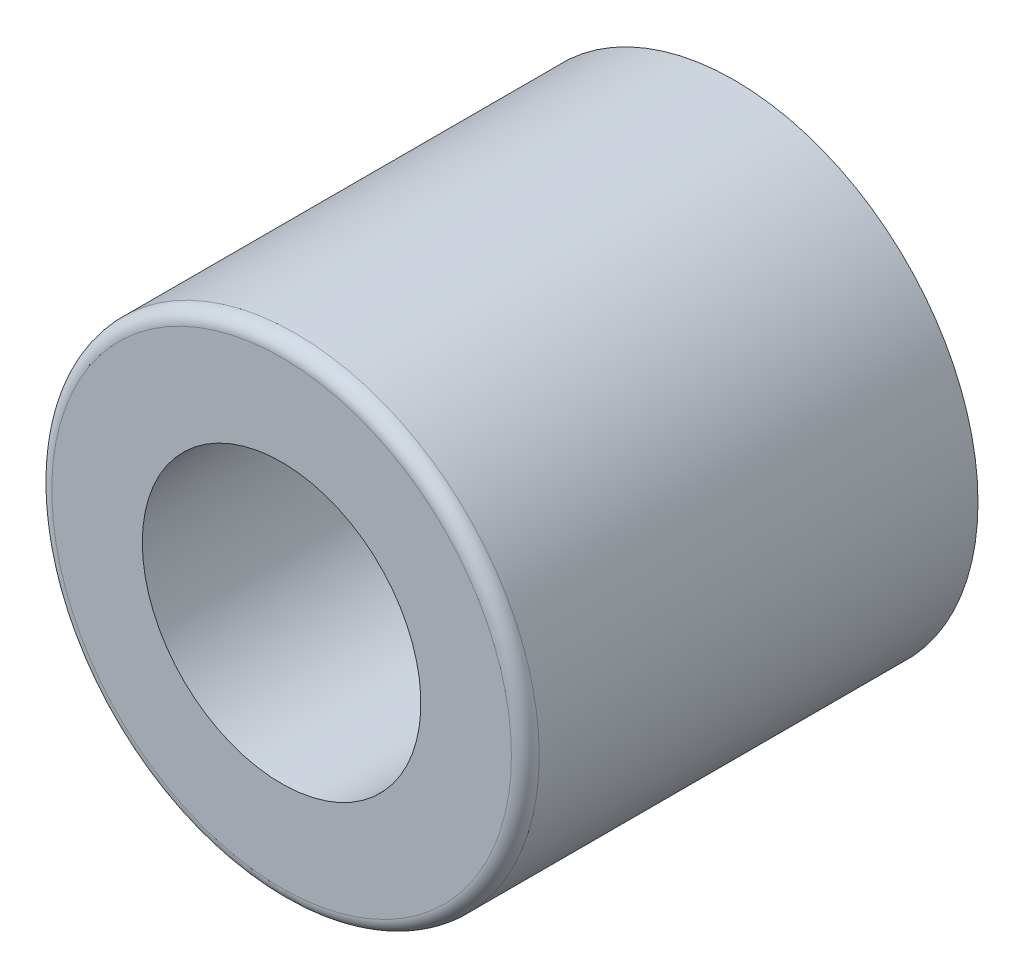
ISO-10303-21;
HEADER;
FILE_DESCRIPTION(('STEP AP214'),'2;1');
FILE_NAME('part.step','',(''),(''),'','','');
FILE_SCHEMA(('AUTOMOTIVE_DESIGN { 1 0 10303 214 1 1 1 1 }'));
ENDSEC;
DATA;
#1=APPLICATION_CONTEXT('core data for automotive mechanical design processes');
#2=APPLICATION_PROTOCOL_DEFINITION('international standard','automotive_design',2000,#1);
#3=PRODUCT_CONTEXT('',#1,'mechanical');
#4=PRODUCT('Part','Part','',(#3));
#5=PRODUCT_RELATED_PRODUCT_CATEGORY('part','',(#4));
#6=PRODUCT_DEFINITION_FORMATION('','',#4);
#7=PRODUCT_DEFINITION_CONTEXT('part definition',#1,'design');
#8=PRODUCT_DEFINITION('design','',#6,#7);
#9=PRODUCT_DEFINITION_SHAPE('','',#8);
#10=(LENGTH_UNIT() NAMED_UNIT(*) SI_UNIT(.MILLI.,.METRE.));
#11=(NAMED_UNIT(*) PLANE_ANGLE_UNIT() SI_UNIT($,.RADIAN.));
#12=(NAMED_UNIT(*) SI_UNIT($,.STERADIAN.) SOLID_ANGLE_UNIT());
#13=UNCERTAINTY_MEASURE_WITH_UNIT(LENGTH_MEASURE(1.E-05),#10,'distance_accuracy_value','');
#14=(GEOMETRIC_REPRESENTATION_CONTEXT(3) GLOBAL_UNCERTAINTY_ASSIGNED_CONTEXT((#13)) GLOBAL_UNIT_ASSIGNED_CONTEXT((#10,
#11,#12)) REPRESENTATION_CONTEXT('',''));
#15=CARTESIAN_POINT('',(0.,0.,0.));
#16=DIRECTION('',(0.,0.,1.));
#17=DIRECTION('',(1.,0.,0.));
#18=AXIS2_PLACEMENT_3D('',#15,#16,#17);
#19=CARTESIAN_POINT('',(0.,0.,6.5));
#20=DIRECTION('',(0.,0.,1.));
#21=DIRECTION('',(1.,0.,0.));
#22=AXIS2_PLACEMENT_3D('',#19,#20,#21);
#23=PLANE('',#22);
#24=CARTESIAN_POINT('',(0.,0.,6.5));
#25=DIRECTION('',(0.,0.,1.));
#26=DIRECTION('',(1.,0.,0.));
#27=AXIS2_PLACEMENT_3D('',#24,#25,#26);
#28=CIRCLE('',#27,3.3);
#29=CARTESIAN_POINT('',(3.3,0.,6.5));
#30=VERTEX_POINT('',#29);
#31=EDGE_CURVE('E34',#30,#30,#28,.T.);
#32=ORIENTED_EDGE('',*,*,#31,.T.);
#33=EDGE_LOOP('',(#32));
#34=FACE_BOUND('',#33,.T.);
#35=CARTESIAN_POINT('',(0.,0.,6.5));
#36=DIRECTION('',(0.,0.,1.));
#37=DIRECTION('',(1.,0.,0.));
#38=AXIS2_PLACEMENT_3D('',#35,#36,#37);
#39=CIRCLE('',#38,2.);
#40=CARTESIAN_POINT('',(-2.,0.,6.5));
#41=VERTEX_POINT('',#40);
#42=EDGE_CURVE('E42',#41,#41,#39,.T.);
#43=ORIENTED_EDGE('',*,*,#42,.F.);
#44=EDGE_LOOP('',(#43));
#45=FACE_BOUND('',#44,.T.);
#46=ADVANCED_FACE('F27',(#34,#45),#23,.T.);
#47=CARTESIAN_POINT('',(0.,0.,0.));
#48=DIRECTION('',(0.,0.,1.));
#49=DIRECTION('',(1.,0.,0.));
#50=AXIS2_PLACEMENT_3D('',#47,#48,#49);
#51=PLANE('',#50);
#52=CARTESIAN_POINT('',(0.,0.,0.));
#53=DIRECTION('',(0.,0.,1.));
#54=DIRECTION('',(1.,0.,0.));
#55=AXIS2_PLACEMENT_3D('',#52,#53,#54);
#56=CIRCLE('',#55,3.5);
#57=CARTESIAN_POINT('',(-3.5,0.,0.));
#58=VERTEX_POINT('',#57);
#59=EDGE_CURVE('E38',#58,#58,#56,.T.);
#60=ORIENTED_EDGE('',*,*,#59,.F.);
#61=EDGE_LOOP('',(#60));
#62=FACE_BOUND('',#61,.T.);
#63=CARTESIAN_POINT('',(0.,0.,0.));
#64=DIRECTION('',(0.,0.,1.));
#65=DIRECTION('',(1.,0.,0.));
#66=AXIS2_PLACEMENT_3D('',#63,#64,#65);
#67=CIRCLE('',#66,2.);
#68=CARTESIAN_POINT('',(-2.,0.,0.));
#69=VERTEX_POINT('',#68);
#70=EDGE_CURVE('E47',#69,#69,#67,.T.);
#71=ORIENTED_EDGE('',*,*,#70,.T.);
#72=EDGE_LOOP('',(#71));
#73=FACE_BOUND('',#72,.T.);
#74=ADVANCED_FACE('F51',(#62,#73),#51,.F.);
#75=CARTESIAN_POINT('',(0.,0.,6.5));
#76=DIRECTION('',(0.,0.,-1.));
#77=DIRECTION('',(-1.,0.,0.));
#78=AXIS2_PLACEMENT_3D('',#75,#76,#77);
#79=CYLINDRICAL_SURFACE('',#78,3.5);
#80=CARTESIAN_POINT('',(0.,0.,6.3));
#81=DIRECTION('',(0.,0.,1.));
#82=DIRECTION('',(1.,0.,0.));
#83=AXIS2_PLACEMENT_3D('',#80,#81,#82);
#84=CIRCLE('',#83,3.5);
#85=CARTESIAN_POINT('',(-3.5,0.,6.3));
#86=VERTEX_POINT('',#85);
#87=EDGE_CURVE('E10',#86,#86,#84,.F.);
#88=CARTESIAN_POINT('',(-3.5,0.,6.3));
#89=CARTESIAN_POINT('',(-3.5,0.,6.234375));
#90=CARTESIAN_POINT('',(-3.5,0.,6.16875));
#91=CARTESIAN_POINT('',(-3.5,0.,6.0375));
#92=CARTESIAN_POINT('',(-3.5,0.,5.971875));
#93=CARTESIAN_POINT('',(-3.5,0.,5.840625));
#94=CARTESIAN_POINT('',(-3.5,0.,5.775));
#95=CARTESIAN_POINT('',(-3.5,0.,5.64375));
#96=CARTESIAN_POINT('',(-3.5,0.,5.578125));
#97=CARTESIAN_POINT('',(-3.5,0.,5.446875));
#98=CARTESIAN_POINT('',(-3.5,0.,5.38125));
#99=CARTESIAN_POINT('',(-3.5,0.,5.25));
#100=CARTESIAN_POINT('',(-3.5,0.,5.184375));
#101=CARTESIAN_POINT('',(-3.5,0.,5.053125));
#102=CARTESIAN_POINT('',(-3.5,0.,4.9875));
#103=CARTESIAN_POINT('',(-3.5,0.,4.85625));
#104=CARTESIAN_POINT('',(-3.5,0.,4.790625));
#105=CARTESIAN_POINT('',(-3.5,0.,4.659375));
#106=CARTESIAN_POINT('',(-3.5,0.,4.59375));
#107=CARTESIAN_POINT('',(-3.5,0.,4.4625));
#108=CARTESIAN_POINT('',(-3.5,0.,4.396875));
#109=CARTESIAN_POINT('',(-3.5,0.,4.265625));
#110=CARTESIAN_POINT('',(-3.5,0.,4.2));
#111=CARTESIAN_POINT('',(-3.5,0.,4.06875));
#112=CARTESIAN_POINT('',(-3.5,0.,4.003125));
#113=CARTESIAN_POINT('',(-3.5,0.,3.871875));
#114=CARTESIAN_POINT('',(-3.5,0.,3.80625));
#115=CARTESIAN_POINT('',(-3.5,0.,3.675));
#116=CARTESIAN_POINT('',(-3.5,0.,3.609375));
#117=CARTESIAN_POINT('',(-3.5,0.,3.478125));
#118=CARTESIAN_POINT('',(-3.5,0.,3.4125));
#119=CARTESIAN_POINT('',(-3.5,0.,3.28125));
#120=CARTESIAN_POINT('',(-3.5,0.,3.215625));
#121=CARTESIAN_POINT('',(-3.5,0.,3.084375));
#122=CARTESIAN_POINT('',(-3.5,0.,3.01875));
#123=CARTESIAN_POINT('',(-3.5,0.,2.8875));
#124=CARTESIAN_POINT('',(-3.5,0.,2.821875));
#125=CARTESIAN_POINT('',(-3.5,0.,2.690625));
#126=CARTESIAN_POINT('',(-3.5,0.,2.625));
#127=CARTESIAN_POINT('',(-3.5,0.,2.49375));
#128=CARTESIAN_POINT('',(-3.5,0.,2.428125));
#129=CARTESIAN_POINT('',(-3.5,0.,2.296875));
#130=CARTESIAN_POINT('',(-3.5,0.,2.23125));
#131=CARTESIAN_POINT('',(-3.5,0.,2.1));
#132=CARTESIAN_POINT('',(-3.5,0.,2.034375));
#133=CARTESIAN_POINT('',(-3.5,0.,1.903125));
#134=CARTESIAN_POINT('',(-3.5,0.,1.8375));
#135=CARTESIAN_POINT('',(-3.5,0.,1.70625));
#136=CARTESIAN_POINT('',(-3.5,0.,1.640625));
#137=CARTESIAN_POINT('',(-3.5,0.,1.509375));
#138=CARTESIAN_POINT('',(-3.5,0.,1.44375));
#139=CARTESIAN_POINT('',(-3.5,0.,1.3125));
#140=CARTESIAN_POINT('',(-3.5,0.,1.246875));
#141=CARTESIAN_POINT('',(-3.5,0.,1.115625));
#142=CARTESIAN_POINT('',(-3.5,0.,1.05));
#143=CARTESIAN_POINT('',(-3.5,0.,0.91875));
#144=CARTESIAN_POINT('',(-3.5,0.,0.853125));
#145=CARTESIAN_POINT('',(-3.5,0.,0.721875));
#146=CARTESIAN_POINT('',(-3.5,0.,0.65625));
#147=CARTESIAN_POINT('',(-3.5,0.,0.525));
#148=CARTESIAN_POINT('',(-3.5,0.,0.459375));
#149=CARTESIAN_POINT('',(-3.5,0.,0.328125));
#150=CARTESIAN_POINT('',(-3.5,0.,0.2625));
#151=CARTESIAN_POINT('',(-3.5,0.,0.13125));
#152=CARTESIAN_POINT('',(-3.5,0.,0.065625));
#153=CARTESIAN_POINT('',(-3.5,0.,0.));
#154=B_SPLINE_CURVE_WITH_KNOTS('',3,(#88,#89,#90,#91,#92,#93,#94,#95,#96,#97,#98,#99,#100,#101,
#102,#103,#104,#105,#106,#107,#108,#109,#110,#111,#112,#113,#114,#115,#116,#117,#118,#119,#120,
#121,#122,#123,#124,#125,#126,#127,#128,#129,#130,#131,#132,#133,#134,#135,#136,#137,#138,#139,
#140,#141,#142,#143,#144,#145,#146,#147,#148,#149,#150,#151,#152,#153),.UNSPECIFIED.,.F.,.F.,(4,
2,2,2,2,2,2,2,2,2,2,2,2,2,2,2,2,2,2,2,2,2,2,2,2,2,2,2,2,2,2,2,4),(0.,0.196875,0.393749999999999,
0.590624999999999,0.787499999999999,0.984374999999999,1.18125,1.378125,1.575,1.771875,1.96875,
2.165625,2.3625,2.559375,2.75625,2.953125,3.15,3.346875,3.54375,3.740625,3.9375,4.134375,
4.33125,4.528125,4.725,4.921875,5.11875,5.315625,5.5125,5.709375,5.90625,6.103125,6.3),.UNSPECIFIED.);
#155=EDGE_CURVE('BSEAM29',#86,#58,#154,.T.);
#156=ORIENTED_EDGE('',*,*,#87,.T.);
#157=ORIENTED_EDGE('',*,*,#59,.T.);
#158=ORIENTED_EDGE('',*,*,#155,.T.);
#159=ORIENTED_EDGE('',*,*,#155,.F.);
#160=EDGE_LOOP('',(#156,#158,#157,#159));
#161=FACE_BOUND('',#160,.T.);
#162=ADVANCED_FACE('F29',(#161),#79,.T.);
#163=CARTESIAN_POINT('',(0.,0.,6.5));
#164=DIRECTION('',(0.,0.,-1.));
#165=DIRECTION('',(-1.,0.,0.));
#166=AXIS2_PLACEMENT_3D('',#163,#164,#165);
#167=CYLINDRICAL_SURFACE('',#166,2.);
#168=CARTESIAN_POINT('',(-2.,0.,6.5));
#169=CARTESIAN_POINT('',(-2.,0.,6.43229166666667));
#170=CARTESIAN_POINT('',(-2.,0.,6.36458333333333));
#171=CARTESIAN_POINT('',(-2.,0.,6.22916666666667));
#172=CARTESIAN_POINT('',(-2.,0.,6.16145833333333));
#173=CARTESIAN_POINT('',(-2.,0.,6.02604166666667));
#174=CARTESIAN_POINT('',(-2.,0.,5.95833333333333));
#175=CARTESIAN_POINT('',(-2.,0.,5.82291666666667));
#176=CARTESIAN_POINT('',(-2.,0.,5.75520833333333));
#177=CARTESIAN_POINT('',(-2.,0.,5.61979166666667));
#178=CARTESIAN_POINT('',(-2.,0.,5.55208333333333));
#179=CARTESIAN_POINT('',(-2.,0.,5.41666666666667));
#180=CARTESIAN_POINT('',(-2.,0.,5.34895833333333));
#181=CARTESIAN_POINT('',(-2.,0.,5.21354166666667));
#182=CARTESIAN_POINT('',(-2.,0.,5.14583333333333));
#183=CARTESIAN_POINT('',(-2.,0.,5.01041666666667));
#184=CARTESIAN_POINT('',(-2.,0.,4.94270833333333));
#185=CARTESIAN_POINT('',(-2.,0.,4.80729166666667));
#186=CARTESIAN_POINT('',(-2.,0.,4.73958333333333));
#187=CARTESIAN_POINT('',(-2.,0.,4.60416666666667));
#188=CARTESIAN_POINT('',(-2.,0.,4.53645833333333));
#189=CARTESIAN_POINT('',(-2.,0.,4.40104166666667));
#190=CARTESIAN_POINT('',(-2.,0.,4.33333333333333));
#191=CARTESIAN_POINT('',(-2.,0.,4.19791666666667));
#192=CARTESIAN_POINT('',(-2.,0.,4.13020833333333));
#193=CARTESIAN_POINT('',(-2.,0.,3.99479166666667));
#194=CARTESIAN_POINT('',(-2.,0.,3.92708333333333));
#195=CARTESIAN_POINT('',(-2.,0.,3.79166666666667));
#196=CARTESIAN_POINT('',(-2.,0.,3.72395833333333));
#197=CARTESIAN_POINT('',(-2.,0.,3.58854166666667));
#198=CARTESIAN_POINT('',(-2.,0.,3.52083333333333));
#199=CARTESIAN_POINT('',(-2.,0.,3.38541666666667));
#200=CARTESIAN_POINT('',(-2.,0.,3.31770833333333));
#201=CARTESIAN_POINT('',(-2.,0.,3.18229166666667));
#202=CARTESIAN_POINT('',(-2.,0.,3.11458333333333));
#203=CARTESIAN_POINT('',(-2.,0.,2.97916666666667));
#204=CARTESIAN_POINT('',(-2.,0.,2.91145833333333));
#205=CARTESIAN_POINT('',(-2.,0.,2.77604166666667));
#206=CARTESIAN_POINT('',(-2.,0.,2.70833333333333));
#207=CARTESIAN_POINT('',(-2.,0.,2.57291666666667));
#208=CARTESIAN_POINT('',(-2.,0.,2.50520833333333));
#209=CARTESIAN_POINT('',(-2.,0.,2.36979166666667));
#210=CARTESIAN_POINT('',(-2.,0.,2.30208333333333));
#211=CARTESIAN_POINT('',(-2.,0.,2.16666666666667));
#212=CARTESIAN_POINT('',(-2.,0.,2.09895833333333));
#213=CARTESIAN_POINT('',(-2.,0.,1.96354166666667));
#214=CARTESIAN_POINT('',(-2.,0.,1.89583333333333));
#215=CARTESIAN_POINT('',(-2.,0.,1.76041666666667));
#216=CARTESIAN_POINT('',(-2.,0.,1.69270833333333));
#217=CARTESIAN_POINT('',(-2.,0.,1.55729166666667));
#218=CARTESIAN_POINT('',(-2.,0.,1.48958333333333));
#219=CARTESIAN_POINT('',(-2.,0.,1.35416666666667));
#220=CARTESIAN_POINT('',(-2.,0.,1.28645833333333));
#221=CARTESIAN_POINT('',(-2.,0.,1.15104166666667));
#222=CARTESIAN_POINT('',(-2.,0.,1.08333333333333));
#223=CARTESIAN_POINT('',(-2.,0.,0.947916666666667));
#224=CARTESIAN_POINT('',(-2.,0.,0.880208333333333));
#225=CARTESIAN_POINT('',(-2.,0.,0.744791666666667));
#226=CARTESIAN_POINT('',(-2.,0.,0.677083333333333));
#227=CARTESIAN_POINT('',(-2.,0.,0.541666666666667));
#228=CARTESIAN_POINT('',(-2.,0.,0.473958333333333));
#229=CARTESIAN_POINT('',(-2.,0.,0.338541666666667));
#230=CARTESIAN_POINT('',(-2.,0.,0.270833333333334));
#231=CARTESIAN_POINT('',(-2.,0.,0.135416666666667));
#232=CARTESIAN_POINT('',(-2.,0.,0.0677083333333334));
#233=CARTESIAN_POINT('',(-2.,0.,0.));
#234=B_SPLINE_CURVE_WITH_KNOTS('',3,(#168,#169,#170,#171,#172,#173,#174,#175,#176,#177,#178,
#179,#180,#181,#182,#183,#184,#185,#186,#187,#188,#189,#190,#191,#192,#193,#194,#195,#196,#197,
#198,#199,#200,#201,#202,#203,#204,#205,#206,#207,#208,#209,#210,#211,#212,#213,#214,#215,#216,
#217,#218,#219,#220,#221,#222,#223,#224,#225,#226,#227,#228,#229,#230,#231,#232,#233),
.UNSPECIFIED.,.F.,.F.,(4,2,2,2,2,2,2,2,2,2,2,2,2,2,2,2,2,2,2,2,2,2,2,2,2,2,2,2,2,2,2,2,4),(0.,
0.203124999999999,0.40625,0.609375,0.812499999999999,1.015625,1.21875,1.421875,1.625,1.828125,
2.03125,2.234375,2.4375,2.640625,2.84375,3.046875,3.25,3.453125,3.65625,3.859375,4.0625,
4.265625,4.46875,4.671875,4.875,5.078125,5.28125,5.484375,5.6875,5.890625,6.09375,6.296875,6.5),.UNSPECIFIED.);
#235=EDGE_CURVE('BSEAM53',#41,#69,#234,.T.);
#236=ORIENTED_EDGE('',*,*,#42,.T.);
#237=ORIENTED_EDGE('',*,*,#70,.F.);
#238=ORIENTED_EDGE('',*,*,#235,.T.);
#239=ORIENTED_EDGE('',*,*,#235,.F.);
#240=EDGE_LOOP('',(#236,#238,#237,#239));
#241=FACE_BOUND('',#240,.T.);
#242=ADVANCED_FACE('F53',(#241),#167,.F.);
#243=CARTESIAN_POINT('',(0.,0.,6.3));
#244=DIRECTION('',(0.,0.,1.));
#245=DIRECTION('',(1.,0.,0.));
#246=AXIS2_PLACEMENT_3D('',#243,#244,#245);
#247=TOROIDAL_SURFACE('',#246,3.3,0.2);
#248=ORIENTED_EDGE('',*,*,#87,.F.);
#249=EDGE_LOOP('',(#248));
#250=FACE_BOUND('',#249,.T.);
#251=ORIENTED_EDGE('',*,*,#31,.F.);
#252=EDGE_LOOP('',(#251));
#253=FACE_BOUND('',#252,.T.);
#254=ADVANCED_FACE('F55',(#250,#253),#247,.T.);
#255=CLOSED_SHELL('',(#46,#74,#162,#242,#254));
#256=MANIFOLD_SOLID_BREP('B2',#255);
#257=ADVANCED_BREP_SHAPE_REPRESENTATION('',(#18,#256),#14);
#258=SHAPE_DEFINITION_REPRESENTATION(#9,#257);
ENDSEC;
END-ISO-10303-21;
